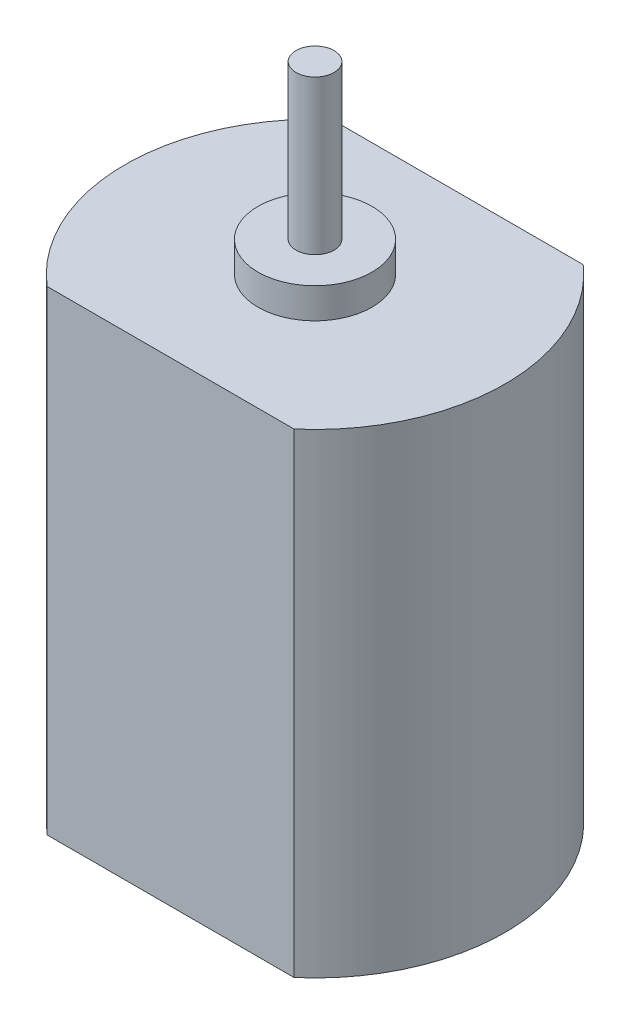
from build123d import *

# Parameters (mm, degrees)
BOSS_EXTRUDE3_DEPTH = 25
SKETCH4_R           = 1
BOSS_EXTRUDE4_DEPTH = 9.7
SKETCH5_R           = 3
BOSS_EXTRUDE5_DEPTH = 1.6


with BuildPart() as part:
    # Sketch3 → Boss-Extrude3 (new body)
    with BuildSketch(Plane(origin=(0, 0, 0), x_dir=(1, 0, 0), z_dir=(0, 1, 0))):
        with BuildLine():
            Line((-6.615929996, 7.498631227), (6.615929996, 7.498631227))
            ThreePointArc((6.615929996, 7.498631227), (9.999693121, -0.078342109), (6.497629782, -7.601368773))
            Line((6.497629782, -7.601368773), (-6.497629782, -7.601368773))
            ThreePointArc((-6.497629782, -7.601368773), (-9.999693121, -0.078342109), (-6.615929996, 7.498631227))
        make_face()
    extrude(amount=BOSS_EXTRUDE3_DEPTH)

    # Sketch4 → Boss-Extrude4 (add)
    with BuildSketch(Plane(origin=(0, 25, 0), x_dir=(1, 0, 0), z_dir=(0, 1, 0))):
        with Locations(Location((0, 0, 0), (0, 0, 270))):
            Circle(SKETCH4_R)
    extrude(amount=BOSS_EXTRUDE4_DEPTH)

    # Sketch5 → Boss-Extrude5 (add)
    with BuildSketch(Plane(origin=(0, 25, 0), x_dir=(1, 0, 0), z_dir=(0, 1, 0))):
        with Locations(Location((0, 0, 0), (0, 0, 270))):
            Circle(SKETCH5_R)
    extrude(amount=BOSS_EXTRUDE5_DEPTH)


solid = part.part
